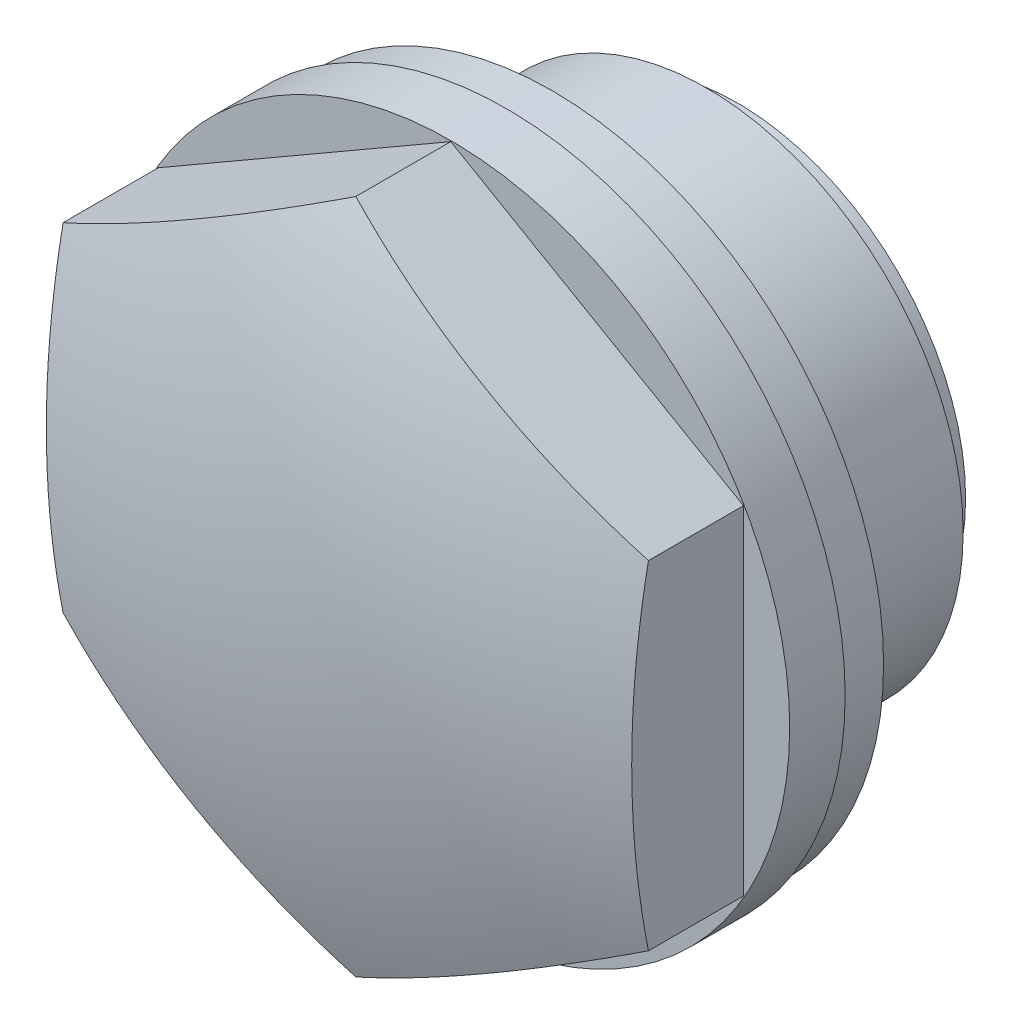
ISO-10303-21;
HEADER;
FILE_DESCRIPTION(('STEP AP214'),'2;1');
FILE_NAME('part.step','',(''),(''),'','','');
FILE_SCHEMA(('AUTOMOTIVE_DESIGN { 1 0 10303 214 1 1 1 1 }'));
ENDSEC;
DATA;
#1=APPLICATION_CONTEXT('core data for automotive mechanical design processes');
#2=APPLICATION_PROTOCOL_DEFINITION('international standard','automotive_design',2000,#1);
#3=PRODUCT_CONTEXT('',#1,'mechanical');
#4=PRODUCT('Part','Part','',(#3));
#5=PRODUCT_RELATED_PRODUCT_CATEGORY('part','',(#4));
#6=PRODUCT_DEFINITION_FORMATION('','',#4);
#7=PRODUCT_DEFINITION_CONTEXT('part definition',#1,'design');
#8=PRODUCT_DEFINITION('design','',#6,#7);
#9=PRODUCT_DEFINITION_SHAPE('','',#8);
#10=(LENGTH_UNIT() NAMED_UNIT(*) SI_UNIT(.MILLI.,.METRE.));
#11=(NAMED_UNIT(*) PLANE_ANGLE_UNIT() SI_UNIT($,.RADIAN.));
#12=(NAMED_UNIT(*) SI_UNIT($,.STERADIAN.) SOLID_ANGLE_UNIT());
#13=UNCERTAINTY_MEASURE_WITH_UNIT(LENGTH_MEASURE(1.E-05),#10,'distance_accuracy_value','');
#14=(GEOMETRIC_REPRESENTATION_CONTEXT(3) GLOBAL_UNCERTAINTY_ASSIGNED_CONTEXT((#13)) GLOBAL_UNIT_ASSIGNED_CONTEXT((#10,
#11,#12)) REPRESENTATION_CONTEXT('',''));
#15=CARTESIAN_POINT('',(0.,0.,0.));
#16=DIRECTION('',(0.,0.,1.));
#17=DIRECTION('',(1.,0.,0.));
#18=AXIS2_PLACEMENT_3D('',#15,#16,#17);
#19=CARTESIAN_POINT('',(0.,0.,8.5));
#20=DIRECTION('',(0.,0.,1.));
#21=DIRECTION('',(1.,0.,0.));
#22=AXIS2_PLACEMENT_3D('',#19,#20,#21);
#23=CYLINDRICAL_SURFACE('',#22,11.);
#24=CARTESIAN_POINT('',(0.,0.,3.30041152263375));
#25=DIRECTION('',(0.,0.,1.));
#26=DIRECTION('',(1.,0.,0.));
#27=AXIS2_PLACEMENT_3D('',#24,#25,#26);
#28=CIRCLE('',#27,11.);
#29=CARTESIAN_POINT('',(11.,0.,3.30041152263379));
#30=VERTEX_POINT('',#29);
#31=EDGE_CURVE('E142',#30,#30,#28,.T.);
#32=ORIENTED_EDGE('',*,*,#31,.F.);
#33=EDGE_LOOP('',(#32));
#34=FACE_BOUND('',#33,.T.);
#35=CARTESIAN_POINT('',(0.,0.,1.5));
#36=DIRECTION('',(0.,0.,1.));
#37=DIRECTION('',(1.,0.,0.));
#38=AXIS2_PLACEMENT_3D('',#35,#36,#37);
#39=CIRCLE('',#38,11.);
#40=CARTESIAN_POINT('',(11.,0.,1.50000000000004));
#41=VERTEX_POINT('',#40);
#42=EDGE_CURVE('E110',#41,#41,#39,.T.);
#43=ORIENTED_EDGE('',*,*,#42,.T.);
#44=EDGE_LOOP('',(#43));
#45=FACE_BOUND('',#44,.T.);
#46=ADVANCED_FACE('F14',(#34,#45),#23,.T.);
#47=CARTESIAN_POINT('',(0.,0.,-22.7520000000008));
#48=DIRECTION('',(0.,0.,1.));
#49=DIRECTION('',(0.,1.,0.));
#50=AXIS2_PLACEMENT_3D('',#47,#48,#49);
#51=SPHERICAL_SURFACE('',#50,29.5020000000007);
#52=CARTESIAN_POINT('',(0.,0.,6.17383827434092));
#53=DIRECTION('',(0.,0.,1.));
#54=DIRECTION('',(1.,0.,0.));
#55=AXIS2_PLACEMENT_3D('',#52,#53,#54);
#56=CIRCLE('',#55,5.80205861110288);
#57=CARTESIAN_POINT('',(5.80205861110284,0.,6.17383827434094));
#58=VERTEX_POINT('',#57);
#59=EDGE_CURVE('E134',#58,#58,#56,.T.);
#60=ORIENTED_EDGE('',*,*,#59,.F.);
#61=EDGE_LOOP('',(#60));
#62=FACE_BOUND('',#61,.T.);
#63=ADVANCED_FACE('F16',(#62),#51,.F.);
#64=CARTESIAN_POINT('',(0.,0.,6.17383827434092));
#65=DIRECTION('',(0.,0.,-1.));
#66=DIRECTION('',(-1.,0.,0.));
#67=AXIS2_PLACEMENT_3D('',#64,#65,#66);
#68=CONICAL_SURFACE('',#67,5.80205861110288,0.0349065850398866);
#69=CARTESIAN_POINT('',(0.,0.,-6.));
#70=DIRECTION('',(0.,0.,1.));
#71=DIRECTION('',(1.,0.,0.));
#72=AXIS2_PLACEMENT_3D('',#69,#70,#71);
#73=CIRCLE('',#72,6.22717841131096);
#74=CARTESIAN_POINT('',(6.22717841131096,0.,-5.99999999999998));
#75=VERTEX_POINT('',#74);
#76=EDGE_CURVE('E131',#75,#75,#73,.T.);
#77=ORIENTED_EDGE('',*,*,#76,.F.);
#78=EDGE_LOOP('',(#77));
#79=FACE_BOUND('',#78,.T.);
#80=ORIENTED_EDGE('',*,*,#59,.T.);
#81=EDGE_LOOP('',(#80));
#82=FACE_BOUND('',#81,.T.);
#83=ADVANCED_FACE('F173',(#79,#82),#68,.F.);
#84=CARTESIAN_POINT('',(0.,6.22717841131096,-6.));
#85=DIRECTION('',(0.,0.,1.));
#86=DIRECTION('',(1.,0.,0.));
#87=AXIS2_PLACEMENT_3D('',#84,#85,#86);
#88=PLANE('',#87);
#89=CARTESIAN_POINT('',(0.,0.,-6.));
#90=DIRECTION('',(0.,0.,1.));
#91=DIRECTION('',(1.,0.,0.));
#92=AXIS2_PLACEMENT_3D('',#89,#90,#91);
#93=CIRCLE('',#92,7.4098475);
#94=CARTESIAN_POINT('',(7.4098475,0.,-5.99999999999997));
#95=VERTEX_POINT('',#94);
#96=EDGE_CURVE('E128',#95,#95,#93,.T.);
#97=ORIENTED_EDGE('',*,*,#96,.F.);
#98=EDGE_LOOP('',(#97));
#99=FACE_BOUND('',#98,.T.);
#100=ORIENTED_EDGE('',*,*,#76,.T.);
#101=EDGE_LOOP('',(#100));
#102=FACE_BOUND('',#101,.T.);
#103=ADVANCED_FACE('F203',(#99,#102),#88,.F.);
#104=CARTESIAN_POINT('',(0.,0.,8.5));
#105=DIRECTION('',(0.,0.,1.));
#106=DIRECTION('',(1.,0.,0.));
#107=AXIS2_PLACEMENT_3D('',#104,#105,#106);
#108=CYLINDRICAL_SURFACE('',#107,7.4098475);
#109=CARTESIAN_POINT('',(0.,0.,-5.));
#110=DIRECTION('',(0.,0.,1.));
#111=DIRECTION('',(1.,0.,0.));
#112=AXIS2_PLACEMENT_3D('',#109,#110,#111);
#113=CIRCLE('',#112,7.4098475);
#114=CARTESIAN_POINT('',(7.4098475,0.,-4.99999999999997));
#115=VERTEX_POINT('',#114);
#116=EDGE_CURVE('E125',#115,#115,#113,.T.);
#117=ORIENTED_EDGE('',*,*,#116,.F.);
#118=EDGE_LOOP('',(#117));
#119=FACE_BOUND('',#118,.T.);
#120=ORIENTED_EDGE('',*,*,#96,.T.);
#121=EDGE_LOOP('',(#120));
#122=FACE_BOUND('',#121,.T.);
#123=ADVANCED_FACE('F199',(#119,#122),#108,.T.);
#124=CARTESIAN_POINT('',(0.,7.4098475,-5.));
#125=DIRECTION('',(0.,0.,1.));
#126=DIRECTION('',(1.,0.,0.));
#127=AXIS2_PLACEMENT_3D('',#124,#125,#126);
#128=PLANE('',#127);
#129=CARTESIAN_POINT('',(0.,0.,-5.));
#130=DIRECTION('',(0.,0.,1.));
#131=DIRECTION('',(1.,0.,0.));
#132=AXIS2_PLACEMENT_3D('',#129,#130,#131);
#133=CIRCLE('',#132,8.33);
#134=CARTESIAN_POINT('',(8.33,0.,-4.99999999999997));
#135=VERTEX_POINT('',#134);
#136=EDGE_CURVE('E122',#135,#135,#133,.T.);
#137=ORIENTED_EDGE('',*,*,#136,.F.);
#138=EDGE_LOOP('',(#137));
#139=FACE_BOUND('',#138,.T.);
#140=ORIENTED_EDGE('',*,*,#116,.T.);
#141=EDGE_LOOP('',(#140));
#142=FACE_BOUND('',#141,.T.);
#143=ADVANCED_FACE('F195',(#139,#142),#128,.F.);
#144=CARTESIAN_POINT('',(0.,0.,8.5));
#145=DIRECTION('',(0.,0.,1.));
#146=DIRECTION('',(1.,0.,0.));
#147=AXIS2_PLACEMENT_3D('',#144,#145,#146);
#148=CYLINDRICAL_SURFACE('',#147,8.33);
#149=CARTESIAN_POINT('',(0.,0.,-0.000214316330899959));
#150=DIRECTION('',(0.,0.,1.));
#151=DIRECTION('',(1.,0.,0.));
#152=AXIS2_PLACEMENT_3D('',#149,#150,#151);
#153=CIRCLE('',#152,8.33);
#154=CARTESIAN_POINT('',(8.32999999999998,0.,-0.000214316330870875));
#155=VERTEX_POINT('',#154);
#156=EDGE_CURVE('E119',#155,#155,#153,.T.);
#157=ORIENTED_EDGE('',*,*,#156,.F.);
#158=EDGE_LOOP('',(#157));
#159=FACE_BOUND('',#158,.T.);
#160=ORIENTED_EDGE('',*,*,#136,.T.);
#161=EDGE_LOOP('',(#160));
#162=FACE_BOUND('',#161,.T.);
#163=ADVANCED_FACE('F191',(#159,#162),#148,.T.);
#164=CARTESIAN_POINT('',(0.,8.33,-0.000214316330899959));
#165=DIRECTION('',(0.,0.,1.));
#166=DIRECTION('',(1.,0.,0.));
#167=AXIS2_PLACEMENT_3D('',#164,#165,#166);
#168=PLANE('',#167);
#169=CARTESIAN_POINT('',(0.,0.,-0.000214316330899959));
#170=DIRECTION('',(0.,0.,1.));
#171=DIRECTION('',(1.,0.,0.));
#172=AXIS2_PLACEMENT_3D('',#169,#170,#171);
#173=CIRCLE('',#172,10.747);
#174=CARTESIAN_POINT('',(10.747,0.,-0.000214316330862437));
#175=VERTEX_POINT('',#174);
#176=EDGE_CURVE('E116',#175,#175,#173,.T.);
#177=ORIENTED_EDGE('',*,*,#176,.F.);
#178=EDGE_LOOP('',(#177));
#179=FACE_BOUND('',#178,.T.);
#180=ORIENTED_EDGE('',*,*,#156,.T.);
#181=EDGE_LOOP('',(#180));
#182=FACE_BOUND('',#181,.T.);
#183=ADVANCED_FACE('F187',(#179,#182),#168,.F.);
#184=CARTESIAN_POINT('',(0.,0.,8.5));
#185=DIRECTION('',(0.,0.,1.));
#186=DIRECTION('',(1.,0.,0.));
#187=AXIS2_PLACEMENT_3D('',#184,#185,#186);
#188=CYLINDRICAL_SURFACE('',#187,10.747);
#189=CARTESIAN_POINT('',(0.,0.,1.5));
#190=DIRECTION('',(0.,0.,1.));
#191=DIRECTION('',(1.,0.,0.));
#192=AXIS2_PLACEMENT_3D('',#189,#190,#191);
#193=CIRCLE('',#192,10.747);
#194=CARTESIAN_POINT('',(10.747,0.,1.50000000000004));
#195=VERTEX_POINT('',#194);
#196=EDGE_CURVE('E113',#195,#195,#193,.T.);
#197=ORIENTED_EDGE('',*,*,#196,.F.);
#198=EDGE_LOOP('',(#197));
#199=FACE_BOUND('',#198,.T.);
#200=ORIENTED_EDGE('',*,*,#176,.T.);
#201=EDGE_LOOP('',(#200));
#202=FACE_BOUND('',#201,.T.);
#203=ADVANCED_FACE('F183',(#199,#202),#188,.T.);
#204=CARTESIAN_POINT('',(0.,10.747,1.5));
#205=DIRECTION('',(0.,0.,1.));
#206=DIRECTION('',(1.,0.,0.));
#207=AXIS2_PLACEMENT_3D('',#204,#205,#206);
#208=PLANE('',#207);
#209=ORIENTED_EDGE('',*,*,#42,.F.);
#210=EDGE_LOOP('',(#209));
#211=FACE_BOUND('',#210,.T.);
#212=ORIENTED_EDGE('',*,*,#196,.T.);
#213=EDGE_LOOP('',(#212));
#214=FACE_BOUND('',#213,.T.);
#215=ADVANCED_FACE('F180',(#211,#214),#208,.F.);
#216=CARTESIAN_POINT('',(0.,0.,-21.002));
#217=DIRECTION('',(0.,0.,1.));
#218=DIRECTION('',(0.,-1.,0.));
#219=AXIS2_PLACEMENT_3D('',#216,#217,#218);
#220=SPHERICAL_SURFACE('',#219,29.502);
#221=CARTESIAN_POINT('',(4.75,8.22724133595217,-21.002));
#222=DIRECTION('',(-0.5,-0.866025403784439,0.));
#223=DIRECTION('',(0.866025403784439,-0.5,0.));
#224=AXIS2_PLACEMENT_3D('',#221,#222,#223);
#225=CIRCLE('',#224,27.930592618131);
#226=CARTESIAN_POINT('',(0.,10.9696551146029,6.3847608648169));
#227=VERTEX_POINT('',#226);
#228=CARTESIAN_POINT('',(9.5,5.48482755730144,6.38476086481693));
#229=VERTEX_POINT('',#228);
#230=EDGE_CURVE('E86',#227,#229,#225,.F.);
#231=ORIENTED_EDGE('',*,*,#230,.F.);
#232=CARTESIAN_POINT('',(-4.75,8.22724133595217,-21.002));
#233=DIRECTION('',(0.5,-0.866025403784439,0.));
#234=DIRECTION('',(0.866025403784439,0.5,0.));
#235=AXIS2_PLACEMENT_3D('',#232,#233,#234);
#236=CIRCLE('',#235,27.930592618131);
#237=CARTESIAN_POINT('',(-9.5,5.48482755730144,6.38476086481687));
#238=VERTEX_POINT('',#237);
#239=EDGE_CURVE('E137',#238,#227,#236,.F.);
#240=ORIENTED_EDGE('',*,*,#239,.F.);
#241=CARTESIAN_POINT('',(-9.5,0.,-21.002));
#242=DIRECTION('',(1.,0.,0.));
#243=DIRECTION('',(0.,0.,-1.));
#244=AXIS2_PLACEMENT_3D('',#241,#242,#243);
#245=CIRCLE('',#244,27.930592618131);
#246=CARTESIAN_POINT('',(-9.5,-5.48482755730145,6.38476086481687));
#247=VERTEX_POINT('',#246);
#248=EDGE_CURVE('E36',#247,#238,#245,.F.);
#249=ORIENTED_EDGE('',*,*,#248,.F.);
#250=CARTESIAN_POINT('',(-4.75,-8.22724133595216,-21.002));
#251=DIRECTION('',(0.5,0.866025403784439,0.));
#252=DIRECTION('',(-0.866025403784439,0.5,0.));
#253=AXIS2_PLACEMENT_3D('',#250,#251,#252);
#254=CIRCLE('',#253,27.930592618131);
#255=CARTESIAN_POINT('',(0.,-10.9696551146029,6.3847608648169));
#256=VERTEX_POINT('',#255);
#257=EDGE_CURVE('E29',#256,#247,#254,.F.);
#258=ORIENTED_EDGE('',*,*,#257,.F.);
#259=CARTESIAN_POINT('',(4.75,-8.22724133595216,-21.002));
#260=DIRECTION('',(-0.5,0.866025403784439,0.));
#261=DIRECTION('',(-0.866025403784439,-0.5,0.));
#262=AXIS2_PLACEMENT_3D('',#259,#260,#261);
#263=CIRCLE('',#262,27.930592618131);
#264=CARTESIAN_POINT('',(9.5,-5.48482755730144,6.38476086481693));
#265=VERTEX_POINT('',#264);
#266=EDGE_CURVE('E99',#265,#256,#263,.F.);
#267=ORIENTED_EDGE('',*,*,#266,.F.);
#268=CARTESIAN_POINT('',(9.5,0.,-21.002));
#269=DIRECTION('',(-1.,0.,0.));
#270=DIRECTION('',(0.,0.,1.));
#271=AXIS2_PLACEMENT_3D('',#268,#269,#270);
#272=CIRCLE('',#271,27.930592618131);
#273=EDGE_CURVE('E9',#229,#265,#272,.F.);
#274=ORIENTED_EDGE('',*,*,#273,.F.);
#275=EDGE_LOOP('',(#231,#240,#249,#258,#267,#274));
#276=FACE_BOUND('',#275,.T.);
#277=ADVANCED_FACE('F151',(#276),#220,.T.);
#278=CARTESIAN_POINT('',(0.,0.,3.30041152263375));
#279=DIRECTION('',(0.,0.,1.));
#280=DIRECTION('',(1.,0.,0.));
#281=AXIS2_PLACEMENT_3D('',#278,#279,#280);
#282=PLANE('',#281);
#283=DIRECTION('',(0.866025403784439,0.5,0.));
#284=VECTOR('',#283,1.);
#285=CARTESIAN_POINT('',(-9.5,5.48482755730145,3.30041152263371));
#286=LINE('',#285,#284);
#287=CARTESIAN_POINT('',(-9.5,5.48482755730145,3.30041152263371));
#288=VERTEX_POINT('',#287);
#289=CARTESIAN_POINT('',(0.,10.9696551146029,3.30041152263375));
#290=VERTEX_POINT('',#289);
#291=EDGE_CURVE('E78',#288,#290,#286,.T.);
#292=ORIENTED_EDGE('',*,*,#291,.T.);
#293=DIRECTION('',(0.866025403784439,-0.5,0.));
#294=VECTOR('',#293,1.);
#295=CARTESIAN_POINT('',(-0.100000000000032,11.0273901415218,3.30041152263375));
#296=LINE('',#295,#294);
#297=CARTESIAN_POINT('',(9.5,5.48482755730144,3.30041152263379));
#298=VERTEX_POINT('',#297);
#299=EDGE_CURVE('E68',#290,#298,#296,.T.);
#300=ORIENTED_EDGE('',*,*,#299,.T.);
#301=DIRECTION('',(0.,-1.,0.));
#302=VECTOR('',#301,1.);
#303=CARTESIAN_POINT('',(9.5,5.48482755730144,3.30041152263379));
#304=LINE('',#303,#302);
#305=CARTESIAN_POINT('',(9.5,-5.48482755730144,3.30041152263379));
#306=VERTEX_POINT('',#305);
#307=EDGE_CURVE('E74',#298,#306,#304,.T.);
#308=ORIENTED_EDGE('',*,*,#307,.T.);
#309=DIRECTION('',(-0.866025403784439,-0.5,0.));
#310=VECTOR('',#309,1.);
#311=CARTESIAN_POINT('',(9.5,-5.48482755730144,3.30041152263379));
#312=LINE('',#311,#310);
#313=CARTESIAN_POINT('',(0.,-10.9696551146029,3.30041152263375));
#314=VERTEX_POINT('',#313);
#315=EDGE_CURVE('E93',#306,#314,#312,.T.);
#316=ORIENTED_EDGE('',*,*,#315,.T.);
#317=DIRECTION('',(-0.866025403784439,0.5,0.));
#318=VECTOR('',#317,1.);
#319=CARTESIAN_POINT('',(0.0999999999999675,-11.0273901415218,3.30041152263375));
#320=LINE('',#319,#318);
#321=CARTESIAN_POINT('',(-9.5,-5.48482755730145,3.30041152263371));
#322=VERTEX_POINT('',#321);
#323=EDGE_CURVE('E101',#314,#322,#320,.T.);
#324=ORIENTED_EDGE('',*,*,#323,.T.);
#325=DIRECTION('',(0.,1.,0.));
#326=VECTOR('',#325,1.);
#327=CARTESIAN_POINT('',(-9.5,-5.48482755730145,3.30041152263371));
#328=LINE('',#327,#326);
#329=EDGE_CURVE('E103',#322,#288,#328,.T.);
#330=ORIENTED_EDGE('',*,*,#329,.T.);
#331=EDGE_LOOP('',(#292,#300,#308,#316,#324,#330));
#332=FACE_BOUND('',#331,.T.);
#333=ORIENTED_EDGE('',*,*,#31,.T.);
#334=EDGE_LOOP('',(#333));
#335=FACE_BOUND('',#334,.T.);
#336=ADVANCED_FACE('F70',(#332,#335),#282,.T.);
#337=CARTESIAN_POINT('',(0.0999999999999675,-11.0273901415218,3.30041152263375));
#338=DIRECTION('',(0.5,0.866025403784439,0.));
#339=DIRECTION('',(-0.866025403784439,0.5,0.));
#340=AXIS2_PLACEMENT_3D('',#337,#338,#339);
#341=PLANE('',#340);
#342=ORIENTED_EDGE('',*,*,#323,.F.);
#343=DIRECTION('',(0.,0.,1.));
#344=VECTOR('',#343,1.);
#345=CARTESIAN_POINT('',(0.,-10.9696551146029,3.30041152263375));
#346=LINE('',#345,#344);
#347=EDGE_CURVE('E22',#314,#256,#346,.T.);
#348=ORIENTED_EDGE('',*,*,#347,.T.);
#349=ORIENTED_EDGE('',*,*,#257,.T.);
#350=DIRECTION('',(0.,0.,1.));
#351=VECTOR('',#350,1.);
#352=CARTESIAN_POINT('',(-9.5,-5.48482755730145,3.30041152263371));
#353=LINE('',#352,#351);
#354=EDGE_CURVE('E108',#322,#247,#353,.T.);
#355=ORIENTED_EDGE('',*,*,#354,.F.);
#356=EDGE_LOOP('',(#342,#348,#349,#355));
#357=FACE_BOUND('',#356,.T.);
#358=ADVANCED_FACE('F147',(#357),#341,.F.);
#359=CARTESIAN_POINT('',(-9.5,5.48482755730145,3.30041152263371));
#360=DIRECTION('',(0.5,-0.866025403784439,0.));
#361=DIRECTION('',(0.866025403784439,0.5,0.));
#362=AXIS2_PLACEMENT_3D('',#359,#360,#361);
#363=PLANE('',#362);
#364=ORIENTED_EDGE('',*,*,#239,.T.);
#365=DIRECTION('',(0.,0.,-1.));
#366=VECTOR('',#365,1.);
#367=CARTESIAN_POINT('',(0.,10.9696551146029,3.30041152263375));
#368=LINE('',#367,#366);
#369=EDGE_CURVE('E145',#227,#290,#368,.T.);
#370=ORIENTED_EDGE('',*,*,#369,.T.);
#371=ORIENTED_EDGE('',*,*,#291,.F.);
#372=DIRECTION('',(0.,0.,1.));
#373=VECTOR('',#372,1.);
#374=CARTESIAN_POINT('',(-9.5,5.48482755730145,3.30041152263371));
#375=LINE('',#374,#373);
#376=EDGE_CURVE('E106',#288,#238,#375,.T.);
#377=ORIENTED_EDGE('',*,*,#376,.T.);
#378=EDGE_LOOP('',(#364,#370,#371,#377));
#379=FACE_BOUND('',#378,.T.);
#380=ADVANCED_FACE('F154',(#379),#363,.F.);
#381=CARTESIAN_POINT('',(-9.5,-5.48482755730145,3.30041152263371));
#382=DIRECTION('',(1.,0.,0.));
#383=DIRECTION('',(0.,0.,-1.));
#384=AXIS2_PLACEMENT_3D('',#381,#382,#383);
#385=PLANE('',#384);
#386=ORIENTED_EDGE('',*,*,#248,.T.);
#387=ORIENTED_EDGE('',*,*,#376,.F.);
#388=ORIENTED_EDGE('',*,*,#329,.F.);
#389=ORIENTED_EDGE('',*,*,#354,.T.);
#390=EDGE_LOOP('',(#386,#387,#388,#389));
#391=FACE_BOUND('',#390,.T.);
#392=ADVANCED_FACE('F156',(#391),#385,.F.);
#393=CARTESIAN_POINT('',(-0.100000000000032,11.0273901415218,3.30041152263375));
#394=DIRECTION('',(-0.5,-0.866025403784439,0.));
#395=DIRECTION('',(0.866025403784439,-0.5,0.));
#396=AXIS2_PLACEMENT_3D('',#393,#394,#395);
#397=PLANE('',#396);
#398=ORIENTED_EDGE('',*,*,#230,.T.);
#399=DIRECTION('',(0.,0.,1.));
#400=VECTOR('',#399,1.);
#401=CARTESIAN_POINT('',(9.5,5.48482755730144,3.30041152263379));
#402=LINE('',#401,#400);
#403=EDGE_CURVE('E83',#298,#229,#402,.T.);
#404=ORIENTED_EDGE('',*,*,#403,.F.);
#405=ORIENTED_EDGE('',*,*,#299,.F.);
#406=ORIENTED_EDGE('',*,*,#369,.F.);
#407=EDGE_LOOP('',(#398,#404,#405,#406));
#408=FACE_BOUND('',#407,.T.);
#409=ADVANCED_FACE('F84',(#408),#397,.F.);
#410=CARTESIAN_POINT('',(9.5,5.48482755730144,3.30041152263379));
#411=DIRECTION('',(-1.,0.,0.));
#412=DIRECTION('',(0.,0.,1.));
#413=AXIS2_PLACEMENT_3D('',#410,#411,#412);
#414=PLANE('',#413);
#415=ORIENTED_EDGE('',*,*,#273,.T.);
#416=DIRECTION('',(0.,0.,1.));
#417=VECTOR('',#416,1.);
#418=CARTESIAN_POINT('',(9.5,-5.48482755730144,3.30041152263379));
#419=LINE('',#418,#417);
#420=EDGE_CURVE('E89',#306,#265,#419,.T.);
#421=ORIENTED_EDGE('',*,*,#420,.F.);
#422=ORIENTED_EDGE('',*,*,#307,.F.);
#423=ORIENTED_EDGE('',*,*,#403,.T.);
#424=EDGE_LOOP('',(#415,#421,#422,#423));
#425=FACE_BOUND('',#424,.T.);
#426=ADVANCED_FACE('F91',(#425),#414,.F.);
#427=CARTESIAN_POINT('',(9.5,-5.48482755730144,3.30041152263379));
#428=DIRECTION('',(-0.5,0.866025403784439,0.));
#429=DIRECTION('',(-0.866025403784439,-0.5,0.));
#430=AXIS2_PLACEMENT_3D('',#427,#428,#429);
#431=PLANE('',#430);
#432=ORIENTED_EDGE('',*,*,#266,.T.);
#433=ORIENTED_EDGE('',*,*,#347,.F.);
#434=ORIENTED_EDGE('',*,*,#315,.F.);
#435=ORIENTED_EDGE('',*,*,#420,.T.);
#436=EDGE_LOOP('',(#432,#433,#434,#435));
#437=FACE_BOUND('',#436,.T.);
#438=ADVANCED_FACE('F157',(#437),#431,.F.);
#439=CLOSED_SHELL('',(#46,#63,#83,#103,#123,#143,#163,#183,#203,#215,#277,#336,#358,#380,#392,
#409,#426,#438));
#440=MANIFOLD_SOLID_BREP('B1',#439);
#441=ADVANCED_BREP_SHAPE_REPRESENTATION('',(#18,#440),#14);
#442=SHAPE_DEFINITION_REPRESENTATION(#9,#441);
ENDSEC;
END-ISO-10303-21;
